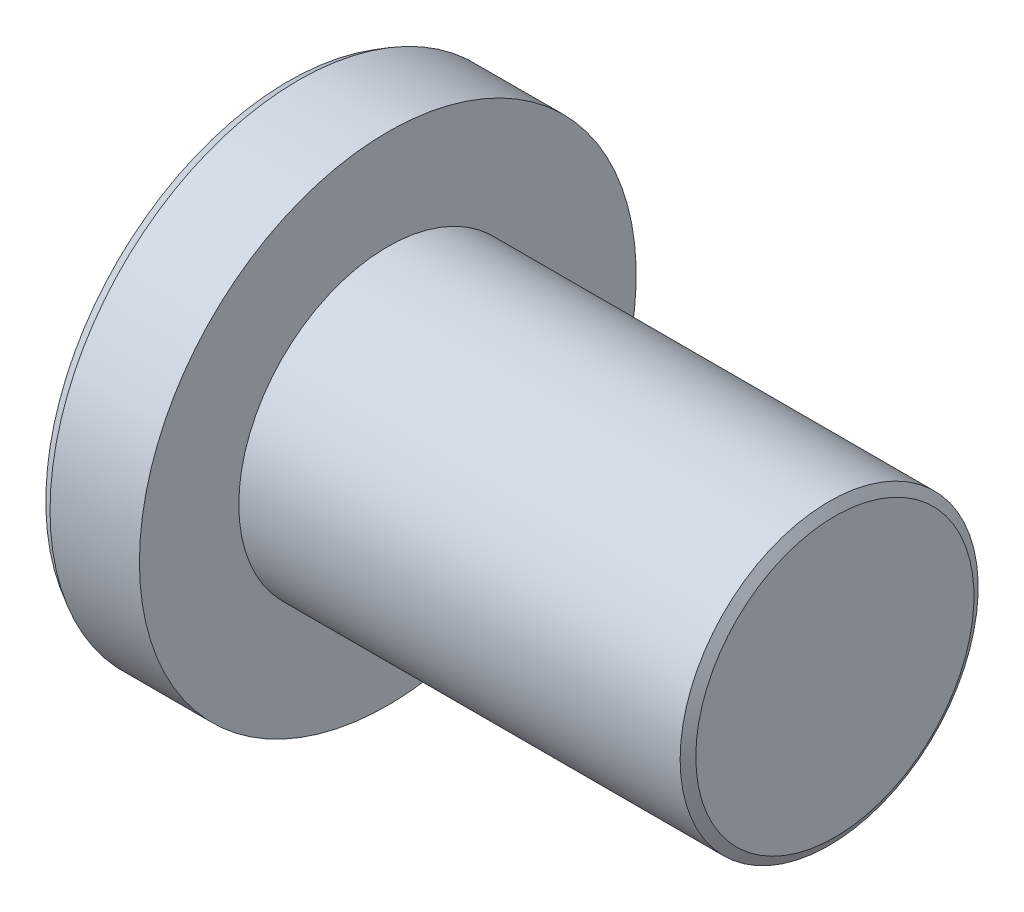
from build123d import *
from OCP.BRepFilletAPI import BRepFilletAPI_MakeChamfer

# Parameters (mm, degrees)
CHANFREIN1_SIZE  = 1
CHANFREIN1_SIZE2 = 0.577350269


with BuildPart() as part:
    # Esquisse1 → R_volution1 (revolve)
    with BuildSketch(Plane.XY, mode=Mode.PRIVATE) as r_volution1_sk:
        Polygon((0, 0), (0, 25), (10, 25), (10, 15), (55, 15), (55, 0), align=None)
    revolve(r_volution1_sk.sketch.rotate(Axis((-45.659776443, 0, 0), (1, 0, 0)), 90), axis=Axis((-45.659776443, 0, 0), (1, 0, 0)))

    # Chanfrein1: one chamfer whose edges measure the first distance from different faces: ONE call of the kernel's chamfer builder (chamfer() names one face for all edges)
    chanfrein1_edges_1 = [part.edges().sort_by_distance(p)[0] for p in [
        (0, 0, -25),
    ]]
    chanfrein1_side_1 = [part.faces().sort_by_distance(p)[0] for p in [
        (5, 0, -25),
    ]]
    chanfrein1_edges_2 = [part.edges().sort_by_distance(p)[0] for p in [
        (55, 0, -15),
    ]]
    chanfrein1_side_2 = [part.faces().sort_by_distance(p)[0] for p in [
        (55, 0, 0),
    ]]
    chanfrein1 = BRepFilletAPI_MakeChamfer(part.part.solid().wrapped)
    for e in chanfrein1_edges_1:
        chanfrein1.Add(CHANFREIN1_SIZE, CHANFREIN1_SIZE2, e.wrapped, chanfrein1_side_1[0].wrapped)  # the first distance lies on this face
    for e in chanfrein1_edges_2:
        chanfrein1.Add(CHANFREIN1_SIZE, CHANFREIN1_SIZE2, e.wrapped, chanfrein1_side_2[0].wrapped)  # the first distance lies on this face
    add(Compound.cast(chanfrein1.Shape()), mode=Mode.REPLACE)


solid = part.part
